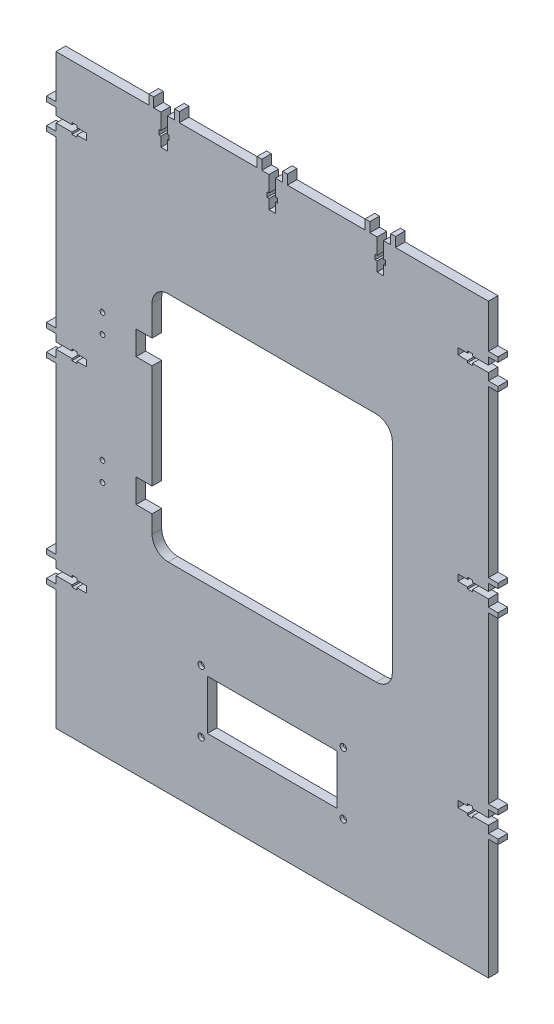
from build123d import *

# Parameters (mm, degrees)
SKETCH1_W               = 270
SKETCH1_H               = 366
BOSS_EXTRUDE1_DEPTH     = 6
CUT_EXTRUDE1_REACH      = 229.486
SKETCH5_R               = 2
SKETCH5_W               = 81
SKETCH5_H               = 31
CUT_EXTRUDE4_DEPTH      = 228.486263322
CUT_EXTRUDE5_DEPTH      = 4
CUT_EXTRUDE6_DEPTH      = 10
SKETCH8_W               = 3
SKETCH8_H               = 6
BOSS_EXTRUDE2_DEPTH     = 6
LPATTERN1_COUNT         = 3
LPATTERN1_PITCH         = 67.5
CUT_EXTRUDE7_DEPTH      = 233.340267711
SKETCH10_W              = 6
SKETCH10_H              = 3
BOSS_EXTRUDE4_DEPTH     = 6
LPATTERN2_COUNT         = 3
LPATTERN2_PITCH         = 122.4
MIRROR1_COPY_1_DEPTH    = 233.340267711
MIRROR1_COPY_2_DEPTH    = 233.340267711
MIRROR1_COPY_3_SKETCH_W = 6
MIRROR1_COPY_3_SKETCH_H = 3
MIRROR1_COPY_3_DEPTH    = 6
MIRROR1_COPY_4_SKETCH_W = 6
MIRROR1_COPY_4_SKETCH_H = 3
MIRROR1_COPY_4_DEPTH    = 6
SKETCH12_R              = 1.5
CUT_EXTRUDE8_DEPTH      = 236.877086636
CUT_EXTRUDE9_DEPTH      = 4
CUT_EXTRUDE10_REACH     = 237.877
SKETCH14_W              = 10
SKETCH14_H              = 15


with BuildPart() as part:
    # Sketch1 → Boss-Extrude1 (new body)
    with BuildSketch(Plane.XY):
        Rectangle(SKETCH1_W, SKETCH1_H)
    extrude(amount=BOSS_EXTRUDE1_DEPTH)

    # Sketch2 → Cut-Extrude1 (cut, up to next)
    with BuildSketch(Plane.XY.offset(6), mode=Mode.PRIVATE) as cut_extrude1_sk1:
        with BuildLine():
            Line((-65, 87), (65, 87))
            ThreePointArc((65, 87), (72.071067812, 84.071067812), (75, 77))
            Line((75, 77), (75, -48))
            ThreePointArc((75, -48), (72.071067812, -55.071067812), (65, -58))
            Line((65, -58), (-65, -58))
            ThreePointArc((-65, -58), (-72.071067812, -55.071067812), (-75, -48))
            Line((-75, -48), (-75, 77))
            ThreePointArc((-75, 77), (-72.071067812, 84.071067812), (-65, 87))
        make_face()
    cut_extrude1_tool1 = extrude(cut_extrude1_sk1.sketch, amount=-CUT_EXTRUDE1_REACH, mode=Mode.PRIVATE) & part.part
    add(cut_extrude1_tool1.solids().sort_by_distance((0, 14.5, 6))[0], mode=Mode.SUBTRACT)

    # Sketch5 → Cut-Extrude4 (cut, through all)
    with BuildSketch(Plane.XY.offset(6)):
        with Locations((-44.375, -103.625)):
            Circle(SKETCH5_R)
        with Locations((44.375, -103.625)):
            Circle(SKETCH5_R)
        with Locations((44.375, -142.375)):
            Circle(SKETCH5_R)
        with Locations((-44.375, -142.375)):
            Circle(SKETCH5_R)
        with Locations((0, -123)):
            Rectangle(SKETCH5_W, SKETCH5_H)
    extrude(amount=-CUT_EXTRUDE4_DEPTH, mode=Mode.SUBTRACT)

    # Sketch6 → Cut-Extrude5 (cut)
    with BuildSketch(Plane(origin=(0, 0, 0), x_dir=(-1, 0, 0), z_dir=(0, 0, -1))):
        Polygon((-40.875, -101.604274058), (-44.375, -99.583548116), (-47.875, -101.604274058), (-47.875, -105.645725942), (-44.375, -107.666451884), (-40.875, -105.645725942), align=None)
        Polygon((40.875, -101.604274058), (40.875, -105.645725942), (44.375, -107.666451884), (47.875, -105.645725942), (47.875, -101.604274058), (44.375, -99.583548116), align=None)
        Polygon((47.875, -140.354274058), (44.375, -138.333548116), (40.875, -140.354274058), (40.875, -144.395725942), (44.375, -146.416451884), (47.875, -144.395725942), align=None)
        Polygon((-40.875, -144.395725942), (-40.875, -140.354274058), (-44.375, -138.333548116), (-47.875, -140.354274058), (-47.875, -144.395725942), (-44.375, -146.416451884), align=None)
    extrude(amount=-CUT_EXTRUDE5_DEPTH, mode=Mode.SUBTRACT)

    # Sketch7 → Cut-Extrude6 (cut)
    with BuildSketch(Plane.XY.offset(6)):
        Polygon((-69.5, 183), (-65.5, 183), (-65.5, 173), (-64.3, 173), (-64.3, 170), (-65.5, 170), (-65.5, 164), (-69.5, 164), (-69.5, 170), (-70.7, 170), (-70.7, 173), (-69.5, 173), align=None)
    cut_extrude6 = extrude(amount=-CUT_EXTRUDE6_DEPTH, mode=Mode.SUBTRACT)

    # Sketch8 → Boss-Extrude2 (add, through all)
    with BuildSketch(Plane.XY.offset(6)):
        with Locations((-75.5, 186)):
            Rectangle(SKETCH8_W, SKETCH8_H)
        with Locations((-59.5, 186)):
            Rectangle(SKETCH8_W, SKETCH8_H)
    boss_extrude2 = extrude(amount=-BOSS_EXTRUDE2_DEPTH)

    # LPattern1: Cut-Extrude6, Boss-Extrude2 ×3
    with Locations(*[(i * LPATTERN1_PITCH, 0, 0) for i in range(1, LPATTERN1_COUNT)]):
        add(cut_extrude6, mode=Mode.SUBTRACT)
        add(boss_extrude2)

    # Sketch9 → Cut-Extrude7 (cut, through all)
    with BuildSketch(Plane.XY.offset(6)):
        Polygon((-135, 148.4), (-125, 148.4), (-125, 149.6), (-122, 149.6), (-122, 148.4), (-116, 148.4), (-116, 144.4), (-122, 144.4), (-122, 143.2), (-125, 143.2), (-125, 144.4), (-135, 144.4), align=None)
    cut_extrude7 = extrude(amount=-CUT_EXTRUDE7_DEPTH, mode=Mode.SUBTRACT)

    # Sketch10 → Boss-Extrude4 (add, through all)
    with BuildSketch(Plane.XY.offset(6)):
        with Locations((-138, 154.4)):
            Rectangle(SKETCH10_W, SKETCH10_H)
        with Locations((-138, 138.4)):
            Rectangle(SKETCH10_W, SKETCH10_H)
    boss_extrude4 = extrude(amount=-BOSS_EXTRUDE4_DEPTH)

    # LPattern2: Cut-Extrude7, Boss-Extrude4 ×3
    with Locations(*[(0, -i * LPATTERN2_PITCH, 0) for i in range(1, LPATTERN2_COUNT)]):
        add(cut_extrude7, mode=Mode.SUBTRACT)
        add(boss_extrude4)

    # Mirror1: Cut-Extrude7, Boss-Extrude4 across plane
    add(cut_extrude7.mirror(Plane(origin=(0, 0, 0), x_dir=(0, 0, 1), z_dir=(1, 0, 0))), mode=Mode.SUBTRACT)
    add(boss_extrude4.mirror(Plane(origin=(0, 0, 0), x_dir=(0, 0, 1), z_dir=(1, 0, 0))))

    # Mirror1 copy 1 sketch → Mirror1 copy 1 (cut, through all)
    with BuildSketch(Plane(origin=(0, -122.4, 6), x_dir=(-1, 0, 0), z_dir=(0, 0, 1))):
        Polygon((-135, -148.4), (-125, -148.4), (-125, -149.6), (-122, -149.6), (-122, -148.4), (-116, -148.4), (-116, -144.4), (-122, -144.4), (-122, -143.2), (-125, -143.2), (-125, -144.4), (-135, -144.4), align=None)
    extrude(amount=-MIRROR1_COPY_1_DEPTH, mode=Mode.SUBTRACT)

    # Mirror1 copy 2 sketch → Mirror1 copy 2 (cut, through all)
    with BuildSketch(Plane(origin=(0, -244.8, 6), x_dir=(-1, 0, 0), z_dir=(0, 0, 1))):
        Polygon((-135, -148.4), (-125, -148.4), (-125, -149.6), (-122, -149.6), (-122, -148.4), (-116, -148.4), (-116, -144.4), (-122, -144.4), (-122, -143.2), (-125, -143.2), (-125, -144.4), (-135, -144.4), align=None)
    extrude(amount=-MIRROR1_COPY_2_DEPTH, mode=Mode.SUBTRACT)

    # Mirror1 copy 3 sketch → Mirror1 copy 3 (add, through all)
    with BuildSketch(Plane(origin=(0, -122.4, 6), x_dir=(-1, 0, 0), z_dir=(0, 0, 1))):
        with Locations((-138, -154.4)):
            Rectangle(MIRROR1_COPY_3_SKETCH_W, MIRROR1_COPY_3_SKETCH_H)
        with Locations((-138, -138.4)):
            Rectangle(MIRROR1_COPY_3_SKETCH_W, MIRROR1_COPY_3_SKETCH_H)
    extrude(amount=-MIRROR1_COPY_3_DEPTH)

    # Mirror1 copy 4 sketch → Mirror1 copy 4 (add, through all)
    with BuildSketch(Plane(origin=(0, -244.8, 6), x_dir=(-1, 0, 0), z_dir=(0, 0, 1))):
        with Locations((-138, -154.4)):
            Rectangle(MIRROR1_COPY_4_SKETCH_W, MIRROR1_COPY_4_SKETCH_H)
        with Locations((-138, -138.4)):
            Rectangle(MIRROR1_COPY_4_SKETCH_W, MIRROR1_COPY_4_SKETCH_H)
    extrude(amount=-MIRROR1_COPY_4_DEPTH)

    # Sketch12 → Cut-Extrude8 (cut, through all)
    with BuildSketch(Plane(origin=(0, 0, 0), x_dir=(-1, 0, 0), z_dir=(0, 0, -1))):
        with Locations((106, 56.5)):
            Circle(SKETCH12_R)
        with Locations((106, 44.5)):
            Circle(SKETCH12_R)
        with Locations((106, -23.5)):
            Circle(SKETCH12_R)
        with Locations((106, -35.5)):
            Circle(SKETCH12_R)
    extrude(amount=-CUT_EXTRUDE8_DEPTH, mode=Mode.SUBTRACT)

    # Sketch13 → Cut-Extrude9 (cut)
    with BuildSketch(Plane(origin=(0, 0, 0), x_dir=(-1, 0, 0), z_dir=(0, 0, -1))):
        Polygon((107.591119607, 53.7441), (109.182239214, 56.5), (107.591119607, 59.2559), (104.408880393, 59.2559), (102.817760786, 56.5), (104.408880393, 53.7441), align=None)
        Polygon((109.182239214, 44.5), (107.591119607, 47.2559), (104.408880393, 47.2559), (102.817760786, 44.5), (104.408880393, 41.7441), (107.591119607, 41.7441), align=None)
        Polygon((107.591119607, -20.7441), (104.408880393, -20.7441), (102.817760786, -23.5), (104.408880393, -26.2559), (107.591119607, -26.2559), (109.182239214, -23.5), align=None)
        Polygon((109.182239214, -35.5), (107.591119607, -32.7441), (104.408880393, -32.7441), (102.817760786, -35.5), (104.408880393, -38.2559), (107.591119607, -38.2559), align=None)
    extrude(amount=-CUT_EXTRUDE9_DEPTH, mode=Mode.SUBTRACT)

    # Sketch14 → Cut-Extrude10 (cut, up to next)
    with BuildSketch(Plane.XY.offset(6), mode=Mode.PRIVATE) as cut_extrude10_sk1:
        with Locations((-80, 50.5)):
            Rectangle(SKETCH14_W, SKETCH14_H)
    cut_extrude10_tool1 = extrude(cut_extrude10_sk1.sketch, amount=-CUT_EXTRUDE10_REACH, mode=Mode.PRIVATE) & part.part
    # Sketch14 → Cut-Extrude10 (cut, up to next)
    with BuildSketch(Plane.XY.offset(6), mode=Mode.PRIVATE) as cut_extrude10_sk2:
        with Locations((-80, -29.5)):
            Rectangle(SKETCH14_W, SKETCH14_H)
    cut_extrude10_tool2 = extrude(cut_extrude10_sk2.sketch, amount=-CUT_EXTRUDE10_REACH, mode=Mode.PRIVATE) & part.part
    add(cut_extrude10_tool1.solids().sort_by_distance((-80, 50.5, 6))[0], mode=Mode.SUBTRACT)
    add(cut_extrude10_tool2.solids().sort_by_distance((-80, -29.5, 6))[0], mode=Mode.SUBTRACT)


solid = part.part
